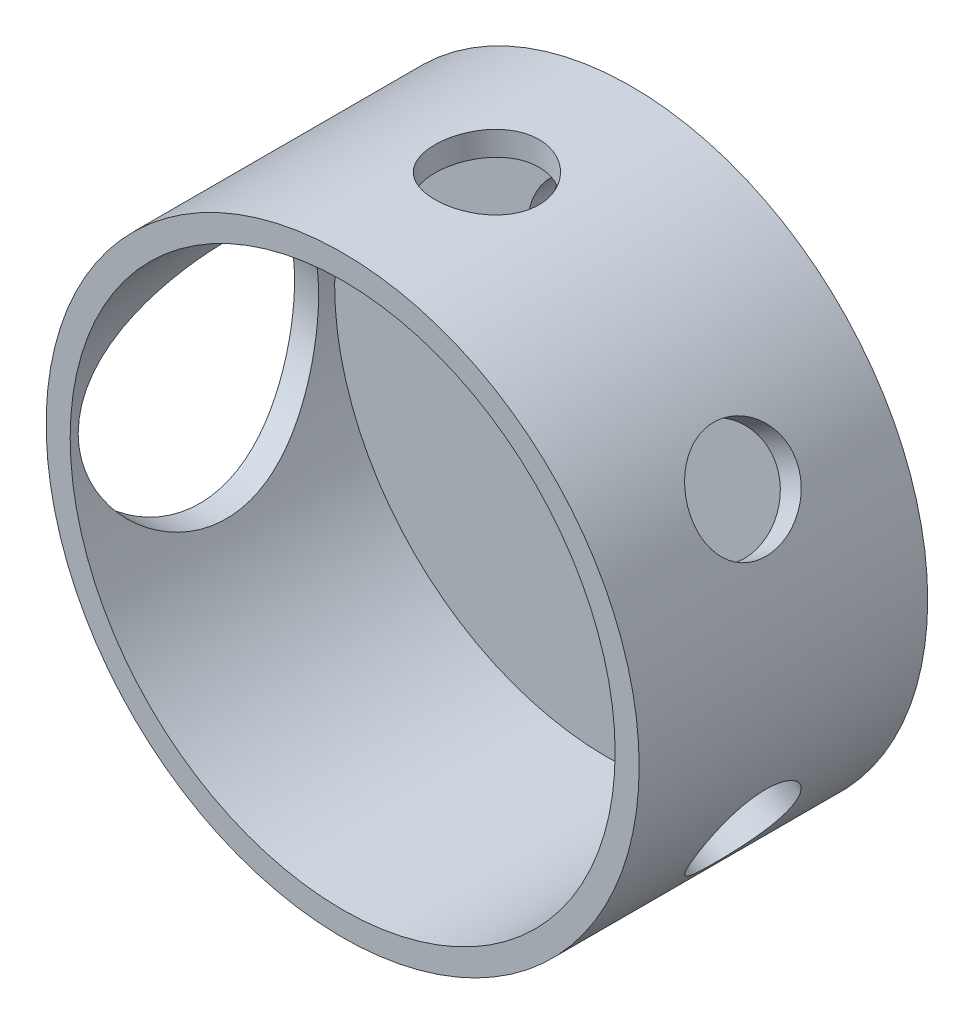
from build123d import *

# Parameters (mm, degrees)
ESQUISSE1_R                  = 37
EXTRUSION1_DEPTH             = 3
ESQUISSE2_R                  = 37
ESQUISSE2_R_2                = 34
EXTRU_MINCE1_DEPTH           = 33
TROU_TARAUD_M51_D            = 4.2
TROU_TARAUD_M51_DEPTH        = 14
TROU_TARAUD_M51_TIP          = 1.2618073
ESQUISSE9_R                  = 10
EXTRUSION3_DEPTH             = 10
ESQUISSE10_R                 = 15
EXTRUSION4_DEPTH             = 10
ESQUISSE11_R                 = 6.5
EXTRUSION5_DEPTH             = 64.513778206
R_P_TITION_CIRCULAIRE1_COUNT = 3
R_P_TITION_CIRCULAIRE1_ANGLE = 120


with BuildPart() as part:
    # Esquisse1 → Extrusion1 (new body)
    with BuildSketch(Plane.XY):
        Circle(ESQUISSE1_R)
    extrude(amount=EXTRUSION1_DEPTH)

    # Esquisse2 → Extru.-Mince1 (add)
    with BuildSketch(Plane.XY.offset(3)):
        Circle(ESQUISSE2_R)
        Circle(ESQUISSE2_R_2, mode=Mode.SUBTRACT)
    extrude(amount=EXTRU_MINCE1_DEPTH)

    # Trou taraud_ M51
    with Locations(Plane.XY.offset(3)):
        with Locations((0, -17)):
            Hole(TROU_TARAUD_M51_D / 2, depth=TROU_TARAUD_M51_DEPTH)
            with Locations((0, 0, -(TROU_TARAUD_M51_DEPTH + TROU_TARAUD_M51_TIP / 2))):  # 118° drill point
                Cone(0, TROU_TARAUD_M51_D / 2, TROU_TARAUD_M51_TIP, mode=Mode.SUBTRACT)

    # Esquisse9 → Extrusion3 (cut)
    with BuildSketch(Plane(origin=(0, 0, 0), x_dir=(-1, 0, 0), z_dir=(0, 0, -1))):
        with Locations((0, 18)):
            Circle(ESQUISSE9_R)
    extrude(amount=-EXTRUSION3_DEPTH, mode=Mode.SUBTRACT)

    # Esquisse10 → Extrusion4 (cut)
    with BuildSketch(Plane(origin=(-37, 0, 0), x_dir=(0, 0, -1), z_dir=(1, 0, 0))):
        with Locations(Location((-20, 0, 0), (0, 0, 180))):
            Circle(ESQUISSE10_R)
    extrude(amount=EXTRUSION4_DEPTH, mode=Mode.SUBTRACT)

    # Esquisse11 → Extrusion5 (cut, through all)
    with BuildSketch(Plane(origin=(0, 0, 0), x_dir=(1, 0, 0), z_dir=(0, 1, 0))):
        with Locations(Location((0, -18, 0), (0, 0, 90))):
            Circle(ESQUISSE11_R)
    extrusion5 = extrude(amount=EXTRUSION5_DEPTH, mode=Mode.SUBTRACT)

    # R_p_tition circulaire1: Extrusion5 ×3 about axis
    r_p_tition_circulaire1_axis = Axis((0, 0, 3), (0, 0, -1))
    for i in range(1, R_P_TITION_CIRCULAIRE1_COUNT):
        add(extrusion5.rotate(r_p_tition_circulaire1_axis, i * R_P_TITION_CIRCULAIRE1_ANGLE / (R_P_TITION_CIRCULAIRE1_COUNT - 1)), mode=Mode.SUBTRACT)


solid = part.part
